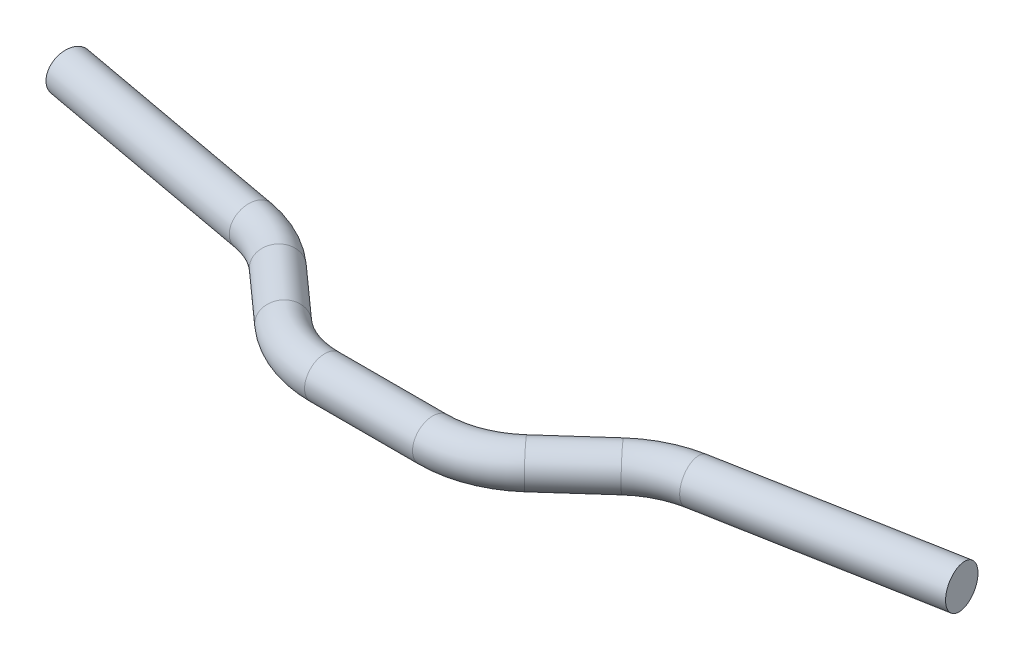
ISO-10303-21;
HEADER;
FILE_DESCRIPTION(('STEP AP214'),'2;1');
FILE_NAME('part.step','',(''),(''),'','','');
FILE_SCHEMA(('AUTOMOTIVE_DESIGN { 1 0 10303 214 1 1 1 1 }'));
ENDSEC;
DATA;
#1=APPLICATION_CONTEXT('core data for automotive mechanical design processes');
#2=APPLICATION_PROTOCOL_DEFINITION('international standard','automotive_design',2000,#1);
#3=PRODUCT_CONTEXT('',#1,'mechanical');
#4=PRODUCT('Part','Part','',(#3));
#5=PRODUCT_RELATED_PRODUCT_CATEGORY('part','',(#4));
#6=PRODUCT_DEFINITION_FORMATION('','',#4);
#7=PRODUCT_DEFINITION_CONTEXT('part definition',#1,'design');
#8=PRODUCT_DEFINITION('design','',#6,#7);
#9=PRODUCT_DEFINITION_SHAPE('','',#8);
#10=(LENGTH_UNIT() NAMED_UNIT(*) SI_UNIT(.MILLI.,.METRE.));
#11=(NAMED_UNIT(*) PLANE_ANGLE_UNIT() SI_UNIT($,.RADIAN.));
#12=(NAMED_UNIT(*) SI_UNIT($,.STERADIAN.) SOLID_ANGLE_UNIT());
#13=UNCERTAINTY_MEASURE_WITH_UNIT(LENGTH_MEASURE(1.E-05),#10,'distance_accuracy_value','');
#14=(GEOMETRIC_REPRESENTATION_CONTEXT(3) GLOBAL_UNCERTAINTY_ASSIGNED_CONTEXT((#13)) GLOBAL_UNIT_ASSIGNED_CONTEXT((#10,
#11,#12)) REPRESENTATION_CONTEXT('',''));
#15=CARTESIAN_POINT('',(0.,0.,0.));
#16=DIRECTION('',(0.,0.,1.));
#17=DIRECTION('',(1.,0.,0.));
#18=AXIS2_PLACEMENT_3D('',#15,#16,#17);
#19=CARTESIAN_POINT('',(420.225933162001,0.,-3.05234146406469));
#20=DIRECTION('',(0.983519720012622,0.,-0.180800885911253));
#21=DIRECTION('',(-0.180800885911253,0.,-0.983519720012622));
#22=AXIS2_PLACEMENT_3D('',#19,#20,#21);
#23=CYLINDRICAL_SURFACE('',#22,12.);
#24=CARTESIAN_POINT('',(420.225933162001,0.,-3.05234146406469));
#25=DIRECTION('',(0.983519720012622,0.,-0.180800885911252));
#26=DIRECTION('',(-0.180800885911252,0.,-0.983519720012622));
#27=AXIS2_PLACEMENT_3D('',#24,#25,#26);
#28=CIRCLE('',#27,12.);
#29=CARTESIAN_POINT('',(418.056322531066,0.,-14.8545781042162));
#30=VERTEX_POINT('',#29);
#31=EDGE_CURVE('E38',#30,#30,#28,.T.);
#32=ORIENTED_EDGE('',*,*,#31,.T.);
#33=EDGE_LOOP('',(#32));
#34=FACE_BOUND('',#33,.T.);
#35=CARTESIAN_POINT('',(553.621821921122,0.,-27.57456951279));
#36=DIRECTION('',(0.983519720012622,0.,-0.180800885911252));
#37=DIRECTION('',(-0.180800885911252,0.,-0.983519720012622));
#38=AXIS2_PLACEMENT_3D('',#35,#36,#37);
#39=CIRCLE('',#38,12.);
#40=CARTESIAN_POINT('',(551.452211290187,0.,-39.3768061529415));
#41=VERTEX_POINT('',#40);
#42=EDGE_CURVE('E10',#41,#41,#39,.T.);
#43=ORIENTED_EDGE('',*,*,#42,.F.);
#44=EDGE_LOOP('',(#43));
#45=FACE_BOUND('',#44,.T.);
#46=ADVANCED_FACE('F32',(#34,#45),#23,.T.);
#47=CARTESIAN_POINT('',(431.073986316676,0.,55.9588417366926));
#48=DIRECTION('',(0.,-1.,0.));
#49=DIRECTION('',(0.,0.,-1.));
#50=AXIS2_PLACEMENT_3D('',#47,#48,#49);
#51=TOROIDAL_SURFACE('',#50,60.,12.);
#52=CARTESIAN_POINT('',(391.045615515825,0.,11.2628740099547));
#53=DIRECTION('',(0.744932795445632,0.,-0.667139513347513));
#54=DIRECTION('',(-0.667139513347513,0.,-0.744932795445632));
#55=AXIS2_PLACEMENT_3D('',#52,#53,#54);
#56=CIRCLE('',#55,12.);
#57=CARTESIAN_POINT('',(383.039941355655,0.,2.3236804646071));
#58=VERTEX_POINT('',#57);
#59=EDGE_CURVE('E42',#58,#58,#56,.T.);
#60=CARTESIAN_POINT('',(431.073986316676,0.,55.9588417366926));
#61=DIRECTION('',(0.,-1.,0.));
#62=DIRECTION('',(0.,0.,-1.));
#63=AXIS2_PLACEMENT_3D('',#60,#61,#62);
#64=CIRCLE('',#63,72.);
#65=EDGE_CURVE('',#58,#30,#64,.T.);
#66=ORIENTED_EDGE('',*,*,#59,.T.);
#67=ORIENTED_EDGE('',*,*,#31,.F.);
#68=ORIENTED_EDGE('',*,*,#65,.T.);
#69=ORIENTED_EDGE('',*,*,#65,.F.);
#70=EDGE_LOOP('',(#66,#68,#67,#69));
#71=FACE_BOUND('',#70,.T.);
#72=ADVANCED_FACE('F103',(#71),#51,.T.);
#73=CARTESIAN_POINT('',(360.710414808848,0.,38.4301717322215));
#74=DIRECTION('',(0.744932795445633,0.,-0.667139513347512));
#75=DIRECTION('',(-0.667139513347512,0.,-0.744932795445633));
#76=AXIS2_PLACEMENT_3D('',#73,#74,#75);
#77=CYLINDRICAL_SURFACE('',#76,12.);
#78=CARTESIAN_POINT('',(360.710414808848,0.,38.4301717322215));
#79=DIRECTION('',(0.744932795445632,0.,-0.667139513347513));
#80=DIRECTION('',(-0.667139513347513,0.,-0.744932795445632));
#81=AXIS2_PLACEMENT_3D('',#78,#79,#80);
#82=CIRCLE('',#81,12.);
#83=CARTESIAN_POINT('',(368.716088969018,0.,47.3693652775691));
#84=VERTEX_POINT('',#83);
#85=EDGE_CURVE('E46',#84,#84,#82,.T.);
#86=ORIENTED_EDGE('',*,*,#85,.T.);
#87=EDGE_LOOP('',(#86));
#88=FACE_BOUND('',#87,.T.);
#89=ORIENTED_EDGE('',*,*,#59,.F.);
#90=EDGE_LOOP('',(#89));
#91=FACE_BOUND('',#90,.T.);
#92=ADVANCED_FACE('F107',(#88,#91),#77,.T.);
#93=CARTESIAN_POINT('',(320.682044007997,0.,-6.26579599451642));
#94=DIRECTION('',(0.,1.,0.));
#95=DIRECTION('',(0.,0.,1.));
#96=AXIS2_PLACEMENT_3D('',#93,#94,#95);
#97=TOROIDAL_SURFACE('',#96,60.,12.);
#98=CARTESIAN_POINT('',(320.682044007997,0.,53.7342040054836));
#99=DIRECTION('',(1.,0.,0.));
#100=DIRECTION('',(0.,0.,-1.));
#101=AXIS2_PLACEMENT_3D('',#98,#99,#100);
#102=CIRCLE('',#101,12.);
#103=CARTESIAN_POINT('',(320.682044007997,0.,65.7342040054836));
#104=VERTEX_POINT('',#103);
#105=EDGE_CURVE('E51',#104,#104,#102,.T.);
#106=CARTESIAN_POINT('',(320.682044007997,0.,-6.26579599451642));
#107=DIRECTION('',(0.,1.,0.));
#108=DIRECTION('',(0.,0.,1.));
#109=AXIS2_PLACEMENT_3D('',#106,#107,#108);
#110=CIRCLE('',#109,72.);
#111=EDGE_CURVE('',#104,#84,#110,.T.);
#112=ORIENTED_EDGE('',*,*,#105,.T.);
#113=ORIENTED_EDGE('',*,*,#85,.F.);
#114=ORIENTED_EDGE('',*,*,#111,.T.);
#115=ORIENTED_EDGE('',*,*,#111,.F.);
#116=EDGE_LOOP('',(#112,#114,#113,#115));
#117=FACE_BOUND('',#116,.T.);
#118=ADVANCED_FACE('F113',(#117),#97,.T.);
#119=CARTESIAN_POINT('',(320.682044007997,0.,53.7342040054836));
#120=DIRECTION('',(-1.,0.,0.));
#121=DIRECTION('',(0.,0.,1.));
#122=AXIS2_PLACEMENT_3D('',#119,#120,#121);
#123=CYLINDRICAL_SURFACE('',#122,12.);
#124=ORIENTED_EDGE('',*,*,#105,.F.);
#125=EDGE_LOOP('',(#124));
#126=FACE_BOUND('',#125,.T.);
#127=CARTESIAN_POINT('',(256.561599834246,0.,53.7342040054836));
#128=DIRECTION('',(1.,0.,0.));
#129=DIRECTION('',(0.,0.,-1.));
#130=AXIS2_PLACEMENT_3D('',#127,#128,#129);
#131=CIRCLE('',#130,12.);
#132=CARTESIAN_POINT('',(256.561599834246,0.,65.7342040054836));
#133=VERTEX_POINT('',#132);
#134=EDGE_CURVE('E66',#133,#133,#131,.T.);
#135=ORIENTED_EDGE('',*,*,#134,.T.);
#136=EDGE_LOOP('',(#135));
#137=FACE_BOUND('',#136,.T.);
#138=ADVANCED_FACE('F70',(#126,#137),#123,.T.);
#139=CARTESIAN_POINT('',(553.621821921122,0.,-27.57456951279));
#140=DIRECTION('',(0.983519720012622,0.,-0.180800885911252));
#141=DIRECTION('',(-0.180800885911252,0.,-0.983519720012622));
#142=AXIS2_PLACEMENT_3D('',#139,#140,#141);
#143=PLANE('',#142);
#144=ORIENTED_EDGE('',*,*,#42,.T.);
#145=EDGE_LOOP('',(#144));
#146=FACE_BOUND('',#145,.T.);
#147=ADVANCED_FACE('F94',(#146),#143,.T.);
#148=CARTESIAN_POINT('',(157.017710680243,0.,-3.05234146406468));
#149=DIRECTION('',(-0.983519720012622,0.,-0.180800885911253));
#150=DIRECTION('',(-0.180800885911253,0.,0.983519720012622));
#151=AXIS2_PLACEMENT_3D('',#148,#149,#150);
#152=CYLINDRICAL_SURFACE('',#151,12.);
#153=CARTESIAN_POINT('',(157.017710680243,0.,-3.05234146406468));
#154=DIRECTION('',(0.983519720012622,0.,0.180800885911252));
#155=DIRECTION('',(0.180800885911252,0.,-0.983519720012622));
#156=AXIS2_PLACEMENT_3D('',#153,#154,#155);
#157=CIRCLE('',#156,12.);
#158=CARTESIAN_POINT('',(159.187321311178,0.,-14.8545781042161));
#159=VERTEX_POINT('',#158);
#160=EDGE_CURVE('E57',#159,#159,#157,.T.);
#161=ORIENTED_EDGE('',*,*,#160,.F.);
#162=EDGE_LOOP('',(#161));
#163=FACE_BOUND('',#162,.T.);
#164=CARTESIAN_POINT('',(23.6218219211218,0.,-27.57456951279));
#165=DIRECTION('',(0.983519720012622,0.,0.180800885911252));
#166=DIRECTION('',(0.180800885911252,0.,-0.983519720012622));
#167=AXIS2_PLACEMENT_3D('',#164,#165,#166);
#168=CIRCLE('',#167,12.);
#169=CARTESIAN_POINT('',(25.7914325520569,0.,-39.3768061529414));
#170=VERTEX_POINT('',#169);
#171=EDGE_CURVE('E54',#170,#170,#168,.T.);
#172=ORIENTED_EDGE('',*,*,#171,.T.);
#173=EDGE_LOOP('',(#172));
#174=FACE_BOUND('',#173,.T.);
#175=ADVANCED_FACE('F88',(#163,#174),#152,.T.);
#176=CARTESIAN_POINT('',(146.169657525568,0.,55.9588417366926));
#177=DIRECTION('',(0.,1.,0.));
#178=DIRECTION('',(0.,0.,1.));
#179=AXIS2_PLACEMENT_3D('',#176,#177,#178);
#180=TOROIDAL_SURFACE('',#179,59.9999999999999,12.);
#181=CARTESIAN_POINT('',(186.198028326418,0.,11.2628740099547));
#182=DIRECTION('',(0.744932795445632,0.,0.667139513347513));
#183=DIRECTION('',(0.667139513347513,0.,-0.744932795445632));
#184=AXIS2_PLACEMENT_3D('',#181,#182,#183);
#185=CIRCLE('',#184,12.);
#186=CARTESIAN_POINT('',(194.203702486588,0.,2.3236804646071));
#187=VERTEX_POINT('',#186);
#188=EDGE_CURVE('E60',#187,#187,#185,.T.);
#189=CARTESIAN_POINT('',(146.169657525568,0.,55.9588417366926));
#190=DIRECTION('',(0.,1.,0.));
#191=DIRECTION('',(0.,0.,1.));
#192=AXIS2_PLACEMENT_3D('',#189,#190,#191);
#193=CIRCLE('',#192,71.9999999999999);
#194=EDGE_CURVE('',#187,#159,#193,.T.);
#195=ORIENTED_EDGE('',*,*,#188,.F.);
#196=ORIENTED_EDGE('',*,*,#160,.T.);
#197=ORIENTED_EDGE('',*,*,#194,.T.);
#198=ORIENTED_EDGE('',*,*,#194,.F.);
#199=EDGE_LOOP('',(#195,#197,#196,#198));
#200=FACE_BOUND('',#199,.T.);
#201=ADVANCED_FACE('F82',(#200),#180,.T.);
#202=CARTESIAN_POINT('',(216.533229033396,0.,38.4301717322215));
#203=DIRECTION('',(-0.744932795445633,0.,-0.667139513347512));
#204=DIRECTION('',(-0.667139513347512,0.,0.744932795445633));
#205=AXIS2_PLACEMENT_3D('',#202,#203,#204);
#206=CYLINDRICAL_SURFACE('',#205,12.);
#207=CARTESIAN_POINT('',(216.533229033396,0.,38.4301717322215));
#208=DIRECTION('',(0.744932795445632,0.,0.667139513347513));
#209=DIRECTION('',(0.667139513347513,0.,-0.744932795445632));
#210=AXIS2_PLACEMENT_3D('',#207,#208,#209);
#211=CIRCLE('',#210,12.);
#212=CARTESIAN_POINT('',(208.527554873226,0.,47.3693652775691));
#213=VERTEX_POINT('',#212);
#214=EDGE_CURVE('E63',#213,#213,#211,.T.);
#215=ORIENTED_EDGE('',*,*,#214,.F.);
#216=EDGE_LOOP('',(#215));
#217=FACE_BOUND('',#216,.T.);
#218=ORIENTED_EDGE('',*,*,#188,.T.);
#219=EDGE_LOOP('',(#218));
#220=FACE_BOUND('',#219,.T.);
#221=ADVANCED_FACE('F76',(#217,#220),#206,.T.);
#222=CARTESIAN_POINT('',(256.561599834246,0.,-6.26579599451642));
#223=DIRECTION('',(0.,-1.,0.));
#224=DIRECTION('',(0.,0.,-1.));
#225=AXIS2_PLACEMENT_3D('',#222,#223,#224);
#226=TOROIDAL_SURFACE('',#225,60.,12.);
#227=CARTESIAN_POINT('',(256.561599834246,0.,-6.26579599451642));
#228=DIRECTION('',(0.,-1.,0.));
#229=DIRECTION('',(0.,0.,-1.));
#230=AXIS2_PLACEMENT_3D('',#227,#228,#229);
#231=CIRCLE('',#230,72.);
#232=EDGE_CURVE('',#133,#213,#231,.T.);
#233=ORIENTED_EDGE('',*,*,#134,.F.);
#234=ORIENTED_EDGE('',*,*,#214,.T.);
#235=ORIENTED_EDGE('',*,*,#232,.T.);
#236=ORIENTED_EDGE('',*,*,#232,.F.);
#237=EDGE_LOOP('',(#233,#235,#234,#236));
#238=FACE_BOUND('',#237,.T.);
#239=ADVANCED_FACE('F72',(#238),#226,.T.);
#240=CARTESIAN_POINT('',(23.6218219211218,0.,-27.57456951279));
#241=DIRECTION('',(-0.983519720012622,0.,-0.180800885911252));
#242=DIRECTION('',(0.180800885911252,0.,-0.983519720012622));
#243=AXIS2_PLACEMENT_3D('',#240,#241,#242);
#244=PLANE('',#243);
#245=ORIENTED_EDGE('',*,*,#171,.F.);
#246=EDGE_LOOP('',(#245));
#247=FACE_BOUND('',#246,.T.);
#248=ADVANCED_FACE('F75',(#247),#244,.T.);
#249=CLOSED_SHELL('',(#46,#72,#92,#118,#138,#147,#175,#201,#221,#239,#248));
#250=MANIFOLD_SOLID_BREP('B2',#249);
#251=ADVANCED_BREP_SHAPE_REPRESENTATION('',(#18,#250),#14);
#252=SHAPE_DEFINITION_REPRESENTATION(#9,#251);
ENDSEC;
END-ISO-10303-21;
